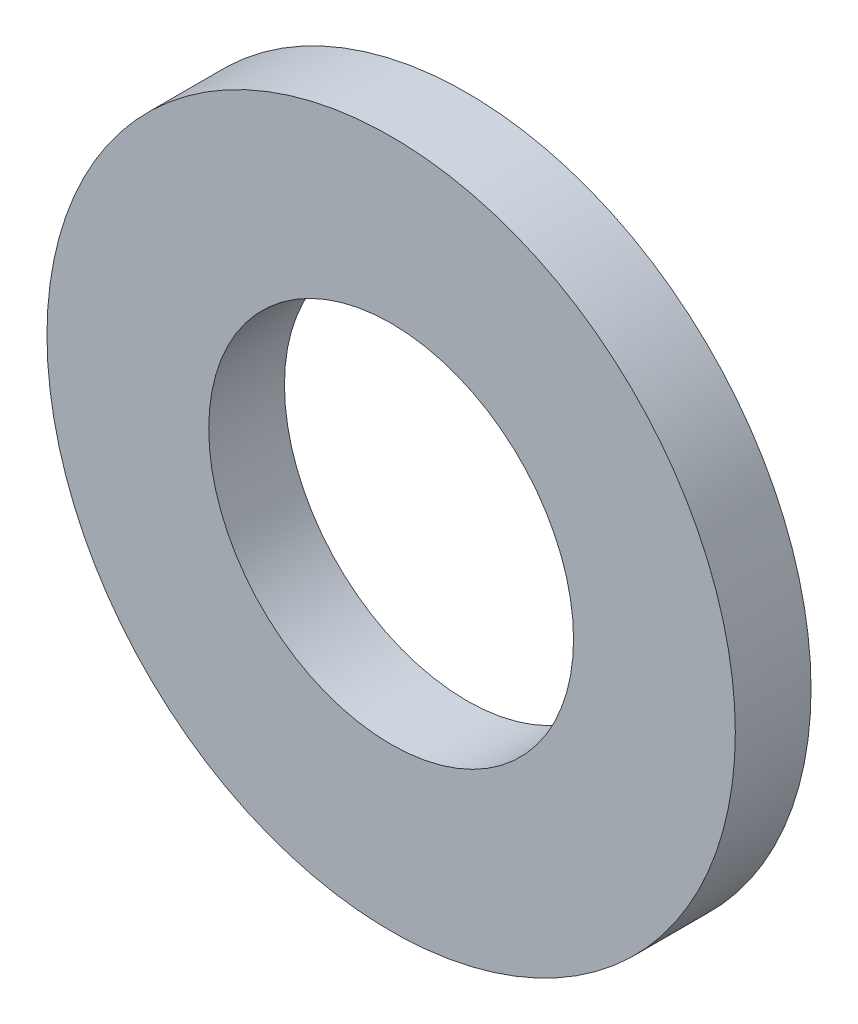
ISO-10303-21;
HEADER;
FILE_DESCRIPTION(('STEP AP214'),'2;1');
FILE_NAME('part.step','',(''),(''),'','','');
FILE_SCHEMA(('AUTOMOTIVE_DESIGN { 1 0 10303 214 1 1 1 1 }'));
ENDSEC;
DATA;
#1=APPLICATION_CONTEXT('core data for automotive mechanical design processes');
#2=APPLICATION_PROTOCOL_DEFINITION('international standard','automotive_design',2000,#1);
#3=PRODUCT_CONTEXT('',#1,'mechanical');
#4=PRODUCT('Part','Part','',(#3));
#5=PRODUCT_RELATED_PRODUCT_CATEGORY('part','',(#4));
#6=PRODUCT_DEFINITION_FORMATION('','',#4);
#7=PRODUCT_DEFINITION_CONTEXT('part definition',#1,'design');
#8=PRODUCT_DEFINITION('design','',#6,#7);
#9=PRODUCT_DEFINITION_SHAPE('','',#8);
#10=(LENGTH_UNIT() NAMED_UNIT(*) SI_UNIT(.MILLI.,.METRE.));
#11=(NAMED_UNIT(*) PLANE_ANGLE_UNIT() SI_UNIT($,.RADIAN.));
#12=(NAMED_UNIT(*) SI_UNIT($,.STERADIAN.) SOLID_ANGLE_UNIT());
#13=UNCERTAINTY_MEASURE_WITH_UNIT(LENGTH_MEASURE(1.E-05),#10,'distance_accuracy_value','');
#14=(GEOMETRIC_REPRESENTATION_CONTEXT(3) GLOBAL_UNCERTAINTY_ASSIGNED_CONTEXT((#13)) GLOBAL_UNIT_ASSIGNED_CONTEXT((#10,
#11,#12)) REPRESENTATION_CONTEXT('',''));
#15=CARTESIAN_POINT('',(0.,0.,0.));
#16=DIRECTION('',(0.,0.,1.));
#17=DIRECTION('',(1.,0.,0.));
#18=AXIS2_PLACEMENT_3D('',#15,#16,#17);
#19=CARTESIAN_POINT('',(0.,0.,1.1));
#20=DIRECTION('',(0.,0.,1.));
#21=DIRECTION('',(1.,0.,0.));
#22=AXIS2_PLACEMENT_3D('',#19,#20,#21);
#23=PLANE('',#22);
#24=CARTESIAN_POINT('',(0.,0.,1.1));
#25=DIRECTION('',(0.,0.,1.));
#26=DIRECTION('',(1.,0.,0.));
#27=AXIS2_PLACEMENT_3D('',#24,#25,#26);
#28=CIRCLE('',#27,5.);
#29=CARTESIAN_POINT('',(5.,0.,1.1));
#30=VERTEX_POINT('',#29);
#31=EDGE_CURVE('E10',#30,#30,#28,.T.);
#32=ORIENTED_EDGE('',*,*,#31,.T.);
#33=EDGE_LOOP('',(#32));
#34=FACE_BOUND('',#33,.T.);
#35=CARTESIAN_POINT('',(0.,0.,1.1));
#36=DIRECTION('',(0.,0.,1.));
#37=DIRECTION('',(1.,0.,0.));
#38=AXIS2_PLACEMENT_3D('',#35,#36,#37);
#39=CIRCLE('',#38,2.65);
#40=CARTESIAN_POINT('',(2.65,0.,1.1));
#41=VERTEX_POINT('',#40);
#42=EDGE_CURVE('E42',#41,#41,#39,.T.);
#43=ORIENTED_EDGE('',*,*,#42,.F.);
#44=EDGE_LOOP('',(#43));
#45=FACE_BOUND('',#44,.T.);
#46=ADVANCED_FACE('F31',(#34,#45),#23,.T.);
#47=CARTESIAN_POINT('',(0.,0.,0.));
#48=DIRECTION('',(0.,0.,1.));
#49=DIRECTION('',(1.,0.,0.));
#50=AXIS2_PLACEMENT_3D('',#47,#48,#49);
#51=PLANE('',#50);
#52=CARTESIAN_POINT('',(0.,0.,0.));
#53=DIRECTION('',(0.,0.,1.));
#54=DIRECTION('',(1.,0.,0.));
#55=AXIS2_PLACEMENT_3D('',#52,#53,#54);
#56=CIRCLE('',#55,5.);
#57=CARTESIAN_POINT('',(5.,0.,0.));
#58=VERTEX_POINT('',#57);
#59=EDGE_CURVE('E35',#58,#58,#56,.T.);
#60=ORIENTED_EDGE('',*,*,#59,.F.);
#61=EDGE_LOOP('',(#60));
#62=FACE_BOUND('',#61,.T.);
#63=CARTESIAN_POINT('',(0.,0.,0.));
#64=DIRECTION('',(0.,0.,1.));
#65=DIRECTION('',(1.,0.,0.));
#66=AXIS2_PLACEMENT_3D('',#63,#64,#65);
#67=CIRCLE('',#66,2.65);
#68=CARTESIAN_POINT('',(2.65,0.,0.));
#69=VERTEX_POINT('',#68);
#70=EDGE_CURVE('E44',#69,#69,#67,.T.);
#71=ORIENTED_EDGE('',*,*,#70,.T.);
#72=EDGE_LOOP('',(#71));
#73=FACE_BOUND('',#72,.T.);
#74=ADVANCED_FACE('F54',(#62,#73),#51,.F.);
#75=CARTESIAN_POINT('',(0.,0.,1.1));
#76=DIRECTION('',(0.,0.,-1.));
#77=DIRECTION('',(-1.,0.,0.));
#78=AXIS2_PLACEMENT_3D('',#75,#76,#77);
#79=CYLINDRICAL_SURFACE('',#78,5.);
#80=ORIENTED_EDGE('',*,*,#31,.F.);
#81=EDGE_LOOP('',(#80));
#82=FACE_BOUND('',#81,.T.);
#83=ORIENTED_EDGE('',*,*,#59,.T.);
#84=EDGE_LOOP('',(#83));
#85=FACE_BOUND('',#84,.T.);
#86=ADVANCED_FACE('F33',(#82,#85),#79,.T.);
#87=CARTESIAN_POINT('',(0.,0.,1.1));
#88=DIRECTION('',(0.,0.,-1.));
#89=DIRECTION('',(-1.,0.,0.));
#90=AXIS2_PLACEMENT_3D('',#87,#88,#89);
#91=CYLINDRICAL_SURFACE('',#90,2.65);
#92=ORIENTED_EDGE('',*,*,#42,.T.);
#93=EDGE_LOOP('',(#92));
#94=FACE_BOUND('',#93,.T.);
#95=ORIENTED_EDGE('',*,*,#70,.F.);
#96=EDGE_LOOP('',(#95));
#97=FACE_BOUND('',#96,.T.);
#98=ADVANCED_FACE('F50',(#94,#97),#91,.F.);
#99=CLOSED_SHELL('',(#46,#74,#86,#98));
#100=MANIFOLD_SOLID_BREP('B2',#99);
#101=ADVANCED_BREP_SHAPE_REPRESENTATION('',(#18,#100),#14);
#102=SHAPE_DEFINITION_REPRESENTATION(#9,#101);
ENDSEC;
END-ISO-10303-21;
